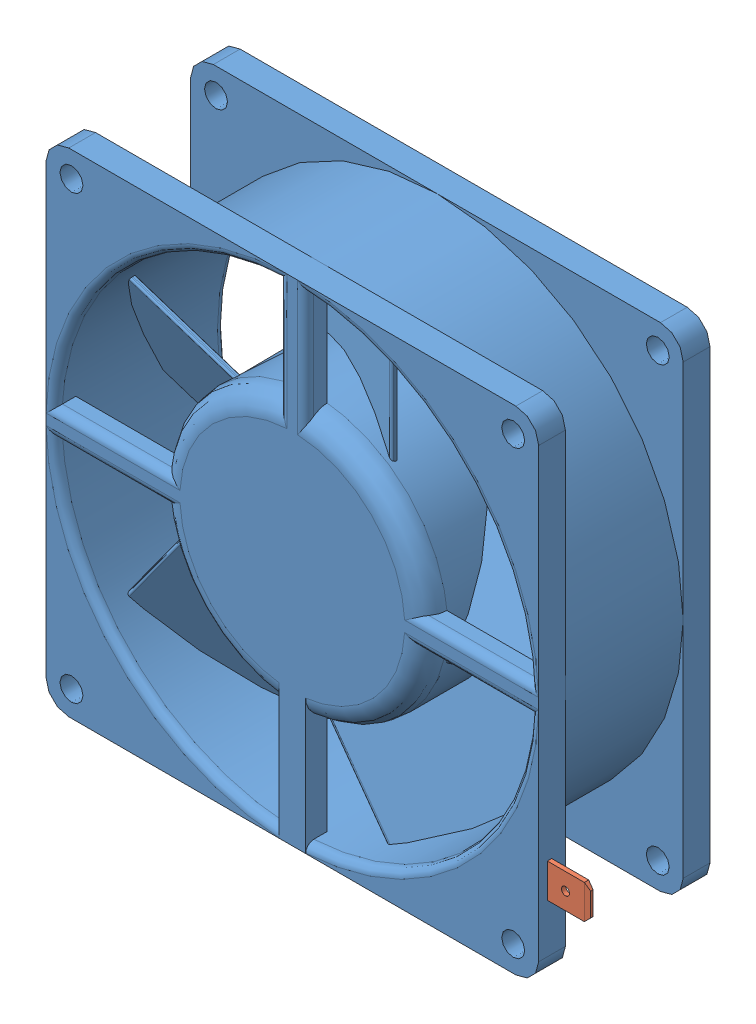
SolidWorks assembly FAN.SLDASM, configuration Default (file format 13000). Lengths in mm.
Overall size (105.02 92.14 32.23).
2 component instances, 2 part files, 3 mates.
Components (placement in the parent):
- FAN_w_CONN-1: FAN_w_CONN.SLDPRT [Default] at (-298.512 61.4211 233.7599) size (97.22 92.14 32.23)
- Slide_Clip_Male-1: Slide_Clip_Male.SLDPRT [Default] at (-249.112 31.9883 237.1425) x (0 1 0) z (1 0 0) size (7.92 0.81 14.02)
Mates (geometry in assembly coordinates):
- Distance1: distance = 1.6175 mm: plane of FAN_w_CONN-1 through (-344.512 107.4211 238.7599) normal (0 0 1); plane of Slide_Clip_Male-1 through (-258.362 29.3137 237.1425) normal (0 0 1)
- Distance2: distance = 13.3922 mm: plane of FAN_w_CONN-1 through (-252.512 15.4211 238.7599) normal (0 -1 0); plane of Slide_Clip_Male-1 through (-244.592 28.8133 236.3325) normal (0 -1 0)
- Coincident3: coincident: plane of FAN_w_CONN-1 through (-252.512 107.4211 238.7599) normal (1 0 0); plane of Slide_Clip_Male-1 through (-252.512 28.8133 236.3325) normal (1 0 0)
